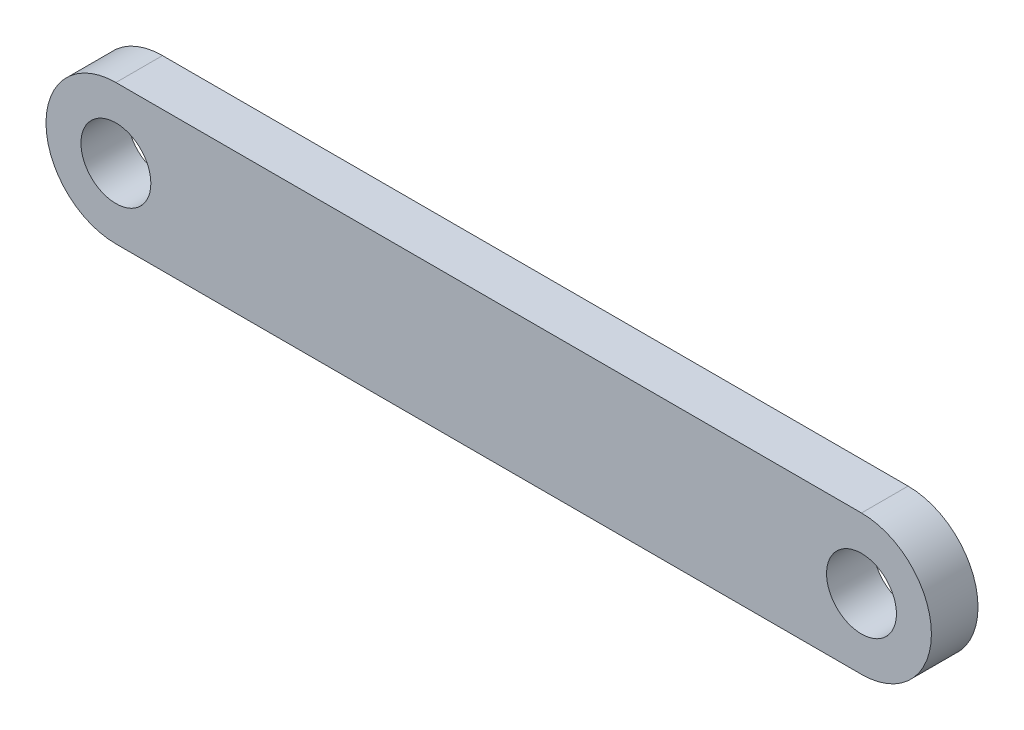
ISO-10303-21;
HEADER;
FILE_DESCRIPTION(('STEP AP214'),'2;1');
FILE_NAME('part.step','',(''),(''),'','','');
FILE_SCHEMA(('AUTOMOTIVE_DESIGN { 1 0 10303 214 1 1 1 1 }'));
ENDSEC;
DATA;
#1=APPLICATION_CONTEXT('core data for automotive mechanical design processes');
#2=APPLICATION_PROTOCOL_DEFINITION('international standard','automotive_design',2000,#1);
#3=PRODUCT_CONTEXT('',#1,'mechanical');
#4=PRODUCT('Part','Part','',(#3));
#5=PRODUCT_RELATED_PRODUCT_CATEGORY('part','',(#4));
#6=PRODUCT_DEFINITION_FORMATION('','',#4);
#7=PRODUCT_DEFINITION_CONTEXT('part definition',#1,'design');
#8=PRODUCT_DEFINITION('design','',#6,#7);
#9=PRODUCT_DEFINITION_SHAPE('','',#8);
#10=(LENGTH_UNIT() NAMED_UNIT(*) SI_UNIT(.MILLI.,.METRE.));
#11=(NAMED_UNIT(*) PLANE_ANGLE_UNIT() SI_UNIT($,.RADIAN.));
#12=(NAMED_UNIT(*) SI_UNIT($,.STERADIAN.) SOLID_ANGLE_UNIT());
#13=UNCERTAINTY_MEASURE_WITH_UNIT(LENGTH_MEASURE(1.E-05),#10,'distance_accuracy_value','');
#14=(GEOMETRIC_REPRESENTATION_CONTEXT(3) GLOBAL_UNCERTAINTY_ASSIGNED_CONTEXT((#13)) GLOBAL_UNIT_ASSIGNED_CONTEXT((#10,
#11,#12)) REPRESENTATION_CONTEXT('',''));
#15=CARTESIAN_POINT('',(0.,0.,0.));
#16=DIRECTION('',(0.,0.,1.));
#17=DIRECTION('',(1.,0.,0.));
#18=AXIS2_PLACEMENT_3D('',#15,#16,#17);
#19=CARTESIAN_POINT('',(0.,0.,6.35));
#20=DIRECTION('',(0.,0.,1.));
#21=DIRECTION('',(1.,0.,0.));
#22=AXIS2_PLACEMENT_3D('',#19,#20,#21);
#23=PLANE('',#22);
#24=CARTESIAN_POINT('',(203.2,0.,6.35));
#25=DIRECTION('',(0.,0.,1.));
#26=DIRECTION('',(1.,0.,0.));
#27=AXIS2_PLACEMENT_3D('',#24,#25,#26);
#28=CIRCLE('',#27,9.52500000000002);
#29=CARTESIAN_POINT('',(212.725,0.,6.35));
#30=VERTEX_POINT('',#29);
#31=EDGE_CURVE('E96',#30,#30,#28,.T.);
#32=ORIENTED_EDGE('',*,*,#31,.F.);
#33=EDGE_LOOP('',(#32));
#34=FACE_BOUND('',#33,.T.);
#35=CARTESIAN_POINT('',(0.,0.,6.35));
#36=DIRECTION('',(0.,0.,1.));
#37=DIRECTION('',(1.,0.,0.));
#38=AXIS2_PLACEMENT_3D('',#35,#36,#37);
#39=CIRCLE('',#38,19.05);
#40=CARTESIAN_POINT('',(0.,19.05,6.35));
#41=VERTEX_POINT('',#40);
#42=CARTESIAN_POINT('',(0.,-19.05,6.35));
#43=VERTEX_POINT('',#42);
#44=EDGE_CURVE('E71',#41,#43,#39,.T.);
#45=ORIENTED_EDGE('',*,*,#44,.T.);
#46=DIRECTION('',(-1.,0.,0.));
#47=VECTOR('',#46,1.);
#48=CARTESIAN_POINT('',(203.2,-19.05,6.35));
#49=LINE('',#48,#47);
#50=CARTESIAN_POINT('',(203.2,-19.05,6.35));
#51=VERTEX_POINT('',#50);
#52=EDGE_CURVE('E78',#51,#43,#49,.T.);
#53=ORIENTED_EDGE('',*,*,#52,.F.);
#54=CARTESIAN_POINT('',(203.2,0.,6.35));
#55=DIRECTION('',(0.,0.,-1.));
#56=DIRECTION('',(-1.,0.,0.));
#57=AXIS2_PLACEMENT_3D('',#54,#55,#56);
#58=CIRCLE('',#57,19.05);
#59=CARTESIAN_POINT('',(203.2,19.05,6.35));
#60=VERTEX_POINT('',#59);
#61=EDGE_CURVE('E86',#60,#51,#58,.T.);
#62=ORIENTED_EDGE('',*,*,#61,.F.);
#63=DIRECTION('',(1.,0.,0.));
#64=VECTOR('',#63,1.);
#65=CARTESIAN_POINT('',(0.,19.05,6.35));
#66=LINE('',#65,#64);
#67=EDGE_CURVE('E89',#41,#60,#66,.T.);
#68=ORIENTED_EDGE('',*,*,#67,.F.);
#69=EDGE_LOOP('',(#45,#53,#62,#68));
#70=FACE_BOUND('',#69,.T.);
#71=CARTESIAN_POINT('',(0.,0.,6.35));
#72=DIRECTION('',(0.,0.,1.));
#73=DIRECTION('',(1.,0.,0.));
#74=AXIS2_PLACEMENT_3D('',#71,#72,#73);
#75=CIRCLE('',#74,9.525);
#76=CARTESIAN_POINT('',(9.525,0.,6.35));
#77=VERTEX_POINT('',#76);
#78=EDGE_CURVE('E109',#77,#77,#75,.T.);
#79=ORIENTED_EDGE('',*,*,#78,.F.);
#80=EDGE_LOOP('',(#79));
#81=FACE_BOUND('',#80,.T.);
#82=ADVANCED_FACE('F30',(#34,#70,#81),#23,.T.);
#83=CARTESIAN_POINT('',(0.,0.,-6.35));
#84=DIRECTION('',(0.,0.,1.));
#85=DIRECTION('',(1.,0.,0.));
#86=AXIS2_PLACEMENT_3D('',#83,#84,#85);
#87=PLANE('',#86);
#88=CARTESIAN_POINT('',(203.2,0.,-6.35));
#89=DIRECTION('',(0.,0.,1.));
#90=DIRECTION('',(1.,0.,0.));
#91=AXIS2_PLACEMENT_3D('',#88,#89,#90);
#92=CIRCLE('',#91,9.52500000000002);
#93=CARTESIAN_POINT('',(212.725,0.,-6.35));
#94=VERTEX_POINT('',#93);
#95=EDGE_CURVE('E106',#94,#94,#92,.T.);
#96=ORIENTED_EDGE('',*,*,#95,.T.);
#97=EDGE_LOOP('',(#96));
#98=FACE_BOUND('',#97,.T.);
#99=CARTESIAN_POINT('',(0.,0.,-6.35));
#100=DIRECTION('',(0.,0.,1.));
#101=DIRECTION('',(1.,0.,0.));
#102=AXIS2_PLACEMENT_3D('',#99,#100,#101);
#103=CIRCLE('',#102,19.05);
#104=CARTESIAN_POINT('',(0.,19.05,-6.35));
#105=VERTEX_POINT('',#104);
#106=CARTESIAN_POINT('',(0.,-19.05,-6.35));
#107=VERTEX_POINT('',#106);
#108=EDGE_CURVE('E94',#105,#107,#103,.T.);
#109=ORIENTED_EDGE('',*,*,#108,.F.);
#110=DIRECTION('',(1.,0.,0.));
#111=VECTOR('',#110,1.);
#112=CARTESIAN_POINT('',(0.,19.05,-6.35));
#113=LINE('',#112,#111);
#114=CARTESIAN_POINT('',(203.2,19.05,-6.35));
#115=VERTEX_POINT('',#114);
#116=EDGE_CURVE('E100',#105,#115,#113,.T.);
#117=ORIENTED_EDGE('',*,*,#116,.T.);
#118=CARTESIAN_POINT('',(203.2,0.,-6.35));
#119=DIRECTION('',(0.,0.,-1.));
#120=DIRECTION('',(-1.,0.,0.));
#121=AXIS2_PLACEMENT_3D('',#118,#119,#120);
#122=CIRCLE('',#121,19.05);
#123=CARTESIAN_POINT('',(203.2,-19.05,-6.35));
#124=VERTEX_POINT('',#123);
#125=EDGE_CURVE('E98',#115,#124,#122,.T.);
#126=ORIENTED_EDGE('',*,*,#125,.T.);
#127=DIRECTION('',(-1.,0.,0.));
#128=VECTOR('',#127,1.);
#129=CARTESIAN_POINT('',(203.2,-19.05,-6.35));
#130=LINE('',#129,#128);
#131=EDGE_CURVE('E80',#124,#107,#130,.T.);
#132=ORIENTED_EDGE('',*,*,#131,.T.);
#133=EDGE_LOOP('',(#109,#117,#126,#132));
#134=FACE_BOUND('',#133,.T.);
#135=CARTESIAN_POINT('',(0.,0.,-6.35));
#136=DIRECTION('',(0.,0.,1.));
#137=DIRECTION('',(1.,0.,0.));
#138=AXIS2_PLACEMENT_3D('',#135,#136,#137);
#139=CIRCLE('',#138,9.525);
#140=CARTESIAN_POINT('',(9.525,0.,-6.35));
#141=VERTEX_POINT('',#140);
#142=EDGE_CURVE('E112',#141,#141,#139,.T.);
#143=ORIENTED_EDGE('',*,*,#142,.T.);
#144=EDGE_LOOP('',(#143));
#145=FACE_BOUND('',#144,.T.);
#146=ADVANCED_FACE('F121',(#98,#134,#145),#87,.F.);
#147=CARTESIAN_POINT('',(0.,0.,6.35));
#148=DIRECTION('',(0.,0.,-1.));
#149=DIRECTION('',(-1.,0.,0.));
#150=AXIS2_PLACEMENT_3D('',#147,#148,#149);
#151=CYLINDRICAL_SURFACE('',#150,19.05);
#152=ORIENTED_EDGE('',*,*,#108,.T.);
#153=DIRECTION('',(0.,0.,-1.));
#154=VECTOR('',#153,1.);
#155=CARTESIAN_POINT('',(0.,-19.05,6.35));
#156=LINE('',#155,#154);
#157=EDGE_CURVE('E11',#43,#107,#156,.T.);
#158=ORIENTED_EDGE('',*,*,#157,.F.);
#159=ORIENTED_EDGE('',*,*,#44,.F.);
#160=DIRECTION('',(0.,0.,-1.));
#161=VECTOR('',#160,1.);
#162=CARTESIAN_POINT('',(0.,19.05,6.35));
#163=LINE('',#162,#161);
#164=EDGE_CURVE('E47',#41,#105,#163,.T.);
#165=ORIENTED_EDGE('',*,*,#164,.T.);
#166=EDGE_LOOP('',(#152,#158,#159,#165));
#167=FACE_BOUND('',#166,.T.);
#168=ADVANCED_FACE('F32',(#167),#151,.T.);
#169=CARTESIAN_POINT('',(203.2,-19.05,6.35));
#170=DIRECTION('',(0.,-1.,0.));
#171=DIRECTION('',(1.,0.,0.));
#172=AXIS2_PLACEMENT_3D('',#169,#170,#171);
#173=PLANE('',#172);
#174=ORIENTED_EDGE('',*,*,#131,.F.);
#175=DIRECTION('',(0.,0.,-1.));
#176=VECTOR('',#175,1.);
#177=CARTESIAN_POINT('',(203.2,-19.05,6.35));
#178=LINE('',#177,#176);
#179=EDGE_CURVE('E39',#51,#124,#178,.T.);
#180=ORIENTED_EDGE('',*,*,#179,.F.);
#181=ORIENTED_EDGE('',*,*,#52,.T.);
#182=ORIENTED_EDGE('',*,*,#157,.T.);
#183=EDGE_LOOP('',(#174,#180,#181,#182));
#184=FACE_BOUND('',#183,.T.);
#185=ADVANCED_FACE('F77',(#184),#173,.T.);
#186=CARTESIAN_POINT('',(203.2,0.,6.35));
#187=DIRECTION('',(0.,0.,-1.));
#188=DIRECTION('',(-1.,0.,0.));
#189=AXIS2_PLACEMENT_3D('',#186,#187,#188);
#190=CYLINDRICAL_SURFACE('',#189,19.05);
#191=ORIENTED_EDGE('',*,*,#125,.F.);
#192=DIRECTION('',(0.,0.,-1.));
#193=VECTOR('',#192,1.);
#194=CARTESIAN_POINT('',(203.2,19.05,6.35));
#195=LINE('',#194,#193);
#196=EDGE_CURVE('E60',#60,#115,#195,.T.);
#197=ORIENTED_EDGE('',*,*,#196,.F.);
#198=ORIENTED_EDGE('',*,*,#61,.T.);
#199=ORIENTED_EDGE('',*,*,#179,.T.);
#200=EDGE_LOOP('',(#191,#197,#198,#199));
#201=FACE_BOUND('',#200,.T.);
#202=ADVANCED_FACE('F88',(#201),#190,.T.);
#203=CARTESIAN_POINT('',(0.,19.05,6.35));
#204=DIRECTION('',(0.,1.,0.));
#205=DIRECTION('',(-1.,0.,0.));
#206=AXIS2_PLACEMENT_3D('',#203,#204,#205);
#207=PLANE('',#206);
#208=ORIENTED_EDGE('',*,*,#116,.F.);
#209=ORIENTED_EDGE('',*,*,#164,.F.);
#210=ORIENTED_EDGE('',*,*,#67,.T.);
#211=ORIENTED_EDGE('',*,*,#196,.T.);
#212=EDGE_LOOP('',(#208,#209,#210,#211));
#213=FACE_BOUND('',#212,.T.);
#214=ADVANCED_FACE('F134',(#213),#207,.T.);
#215=CARTESIAN_POINT('',(203.2,0.,6.35));
#216=DIRECTION('',(0.,0.,-1.));
#217=DIRECTION('',(-1.,0.,0.));
#218=AXIS2_PLACEMENT_3D('',#215,#216,#217);
#219=CYLINDRICAL_SURFACE('',#218,9.52500000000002);
#220=ORIENTED_EDGE('',*,*,#31,.T.);
#221=EDGE_LOOP('',(#220));
#222=FACE_BOUND('',#221,.T.);
#223=ORIENTED_EDGE('',*,*,#95,.F.);
#224=EDGE_LOOP('',(#223));
#225=FACE_BOUND('',#224,.T.);
#226=ADVANCED_FACE('F131',(#222,#225),#219,.F.);
#227=CARTESIAN_POINT('',(0.,0.,6.35));
#228=DIRECTION('',(0.,0.,-1.));
#229=DIRECTION('',(-1.,0.,0.));
#230=AXIS2_PLACEMENT_3D('',#227,#228,#229);
#231=CYLINDRICAL_SURFACE('',#230,9.525);
#232=ORIENTED_EDGE('',*,*,#78,.T.);
#233=EDGE_LOOP('',(#232));
#234=FACE_BOUND('',#233,.T.);
#235=ORIENTED_EDGE('',*,*,#142,.F.);
#236=EDGE_LOOP('',(#235));
#237=FACE_BOUND('',#236,.T.);
#238=ADVANCED_FACE('F118',(#234,#237),#231,.F.);
#239=CLOSED_SHELL('',(#82,#146,#168,#185,#202,#214,#226,#238));
#240=MANIFOLD_SOLID_BREP('B2',#239);
#241=ADVANCED_BREP_SHAPE_REPRESENTATION('',(#18,#240),#14);
#242=SHAPE_DEFINITION_REPRESENTATION(#9,#241);
ENDSEC;
END-ISO-10303-21;
